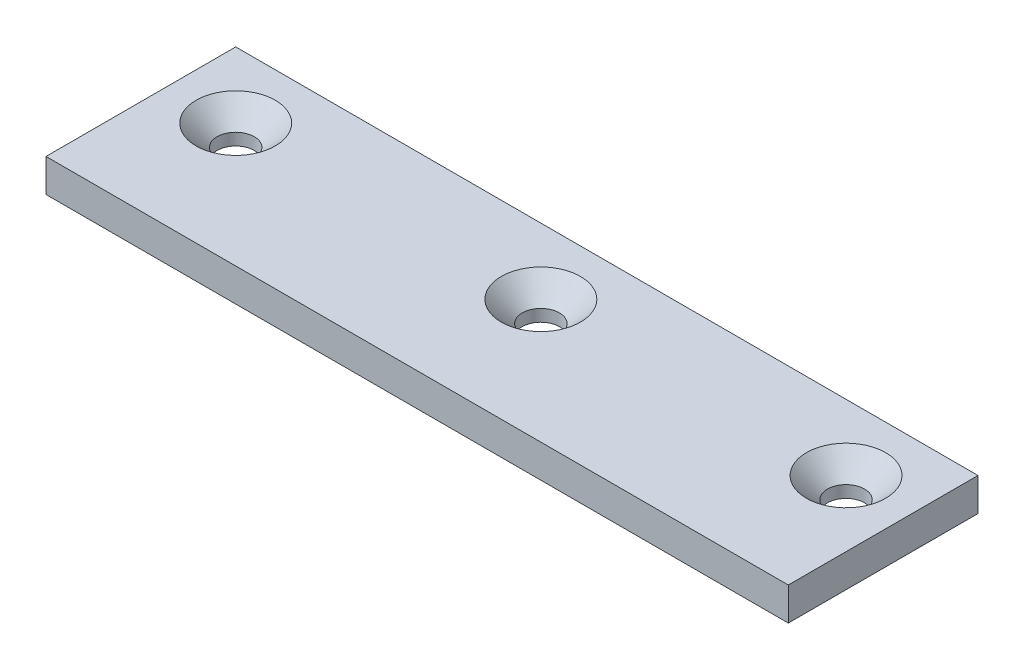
ISO-10303-21;
HEADER;
FILE_DESCRIPTION(('STEP AP214'),'2;1');
FILE_NAME('part.step','',(''),(''),'','','');
FILE_SCHEMA(('AUTOMOTIVE_DESIGN { 1 0 10303 214 1 1 1 1 }'));
ENDSEC;
DATA;
#1=APPLICATION_CONTEXT('core data for automotive mechanical design processes');
#2=APPLICATION_PROTOCOL_DEFINITION('international standard','automotive_design',2000,#1);
#3=PRODUCT_CONTEXT('',#1,'mechanical');
#4=PRODUCT('Part','Part','',(#3));
#5=PRODUCT_RELATED_PRODUCT_CATEGORY('part','',(#4));
#6=PRODUCT_DEFINITION_FORMATION('','',#4);
#7=PRODUCT_DEFINITION_CONTEXT('part definition',#1,'design');
#8=PRODUCT_DEFINITION('design','',#6,#7);
#9=PRODUCT_DEFINITION_SHAPE('','',#8);
#10=(LENGTH_UNIT() NAMED_UNIT(*) SI_UNIT(.MILLI.,.METRE.));
#11=(NAMED_UNIT(*) PLANE_ANGLE_UNIT() SI_UNIT($,.RADIAN.));
#12=(NAMED_UNIT(*) SI_UNIT($,.STERADIAN.) SOLID_ANGLE_UNIT());
#13=UNCERTAINTY_MEASURE_WITH_UNIT(LENGTH_MEASURE(1.E-05),#10,'distance_accuracy_value','');
#14=(GEOMETRIC_REPRESENTATION_CONTEXT(3) GLOBAL_UNCERTAINTY_ASSIGNED_CONTEXT((#13)) GLOBAL_UNIT_ASSIGNED_CONTEXT((#10,
#11,#12)) REPRESENTATION_CONTEXT('',''));
#15=CARTESIAN_POINT('',(0.,0.,0.));
#16=DIRECTION('',(0.,0.,1.));
#17=DIRECTION('',(1.,0.,0.));
#18=AXIS2_PLACEMENT_3D('',#15,#16,#17);
#19=CARTESIAN_POINT('',(-37.,3.99999999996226,-3.49999999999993));
#20=DIRECTION('',(0.,1.,0.));
#21=DIRECTION('',(0.,0.,1.));
#22=AXIS2_PLACEMENT_3D('',#19,#20,#21);
#23=CONICAL_SURFACE('',#22,4.80000000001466,0.785398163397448);
#24=CARTESIAN_POINT('',(-37.,1.45,-3.49999999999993));
#25=DIRECTION('',(0.,1.,0.));
#26=DIRECTION('',(0.,0.,1.));
#27=AXIS2_PLACEMENT_3D('',#24,#25,#26);
#28=CIRCLE('',#27,2.25);
#29=CARTESIAN_POINT('',(-37.,1.45,-1.24999999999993));
#30=VERTEX_POINT('',#29);
#31=EDGE_CURVE('E87',#30,#30,#28,.F.);
#32=ORIENTED_EDGE('',*,*,#31,.T.);
#33=EDGE_LOOP('',(#32));
#34=FACE_BOUND('',#33,.T.);
#35=CARTESIAN_POINT('',(-37.,3.99999999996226,-3.49999999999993));
#36=DIRECTION('',(0.,1.,0.));
#37=DIRECTION('',(0.,0.,1.));
#38=AXIS2_PLACEMENT_3D('',#35,#36,#37);
#39=CIRCLE('',#38,4.80000000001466);
#40=CARTESIAN_POINT('',(-37.,3.99999999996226,1.30000000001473));
#41=VERTEX_POINT('',#40);
#42=EDGE_CURVE('E20',#41,#41,#39,.F.);
#43=ORIENTED_EDGE('',*,*,#42,.F.);
#44=EDGE_LOOP('',(#43));
#45=FACE_BOUND('',#44,.T.);
#46=ADVANCED_FACE('F17',(#34,#45),#23,.F.);
#47=CARTESIAN_POINT('',(0.,3.99999999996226,-3.49999999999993));
#48=DIRECTION('',(0.,1.,0.));
#49=DIRECTION('',(0.,0.,1.));
#50=AXIS2_PLACEMENT_3D('',#47,#48,#49);
#51=CONICAL_SURFACE('',#50,4.79999999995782,0.785398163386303);
#52=CARTESIAN_POINT('',(0.,1.45,-3.49999999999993));
#53=DIRECTION('',(0.,1.,0.));
#54=DIRECTION('',(0.,0.,1.));
#55=AXIS2_PLACEMENT_3D('',#52,#53,#54);
#56=CIRCLE('',#55,2.25);
#57=CARTESIAN_POINT('',(0.,1.45,-1.24999999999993));
#58=VERTEX_POINT('',#57);
#59=EDGE_CURVE('E84',#58,#58,#56,.F.);
#60=ORIENTED_EDGE('',*,*,#59,.T.);
#61=EDGE_LOOP('',(#60));
#62=FACE_BOUND('',#61,.T.);
#63=CARTESIAN_POINT('',(0.,3.99999999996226,-3.49999999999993));
#64=DIRECTION('',(0.,1.,0.));
#65=DIRECTION('',(0.,0.,1.));
#66=AXIS2_PLACEMENT_3D('',#63,#64,#65);
#67=CIRCLE('',#66,4.79999999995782);
#68=CARTESIAN_POINT('',(0.,3.99999999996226,1.29999999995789));
#69=VERTEX_POINT('',#68);
#70=EDGE_CURVE('E102',#69,#69,#67,.F.);
#71=ORIENTED_EDGE('',*,*,#70,.F.);
#72=EDGE_LOOP('',(#71));
#73=FACE_BOUND('',#72,.T.);
#74=ADVANCED_FACE('F111',(#62,#73),#51,.F.);
#75=CARTESIAN_POINT('',(37.,3.99999999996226,-3.49999999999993));
#76=DIRECTION('',(0.,1.,0.));
#77=DIRECTION('',(0.,0.,1.));
#78=AXIS2_PLACEMENT_3D('',#75,#76,#77);
#79=CONICAL_SURFACE('',#78,4.80000000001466,0.785398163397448);
#80=CARTESIAN_POINT('',(37.,1.45,-3.49999999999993));
#81=DIRECTION('',(0.,1.,0.));
#82=DIRECTION('',(0.,0.,1.));
#83=AXIS2_PLACEMENT_3D('',#80,#81,#82);
#84=CIRCLE('',#83,2.25);
#85=CARTESIAN_POINT('',(37.,1.45,-1.24999999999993));
#86=VERTEX_POINT('',#85);
#87=EDGE_CURVE('E67',#86,#86,#84,.F.);
#88=ORIENTED_EDGE('',*,*,#87,.T.);
#89=EDGE_LOOP('',(#88));
#90=FACE_BOUND('',#89,.T.);
#91=CARTESIAN_POINT('',(37.,3.99999999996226,-3.49999999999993));
#92=DIRECTION('',(0.,1.,0.));
#93=DIRECTION('',(0.,0.,1.));
#94=AXIS2_PLACEMENT_3D('',#91,#92,#93);
#95=CIRCLE('',#94,4.80000000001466);
#96=CARTESIAN_POINT('',(37.,3.99999999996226,1.30000000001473));
#97=VERTEX_POINT('',#96);
#98=EDGE_CURVE('E90',#97,#97,#95,.F.);
#99=ORIENTED_EDGE('',*,*,#98,.F.);
#100=EDGE_LOOP('',(#99));
#101=FACE_BOUND('',#100,.T.);
#102=ADVANCED_FACE('F117',(#90,#101),#79,.F.);
#103=CARTESIAN_POINT('',(0.,4.,0.));
#104=DIRECTION('',(0.,1.,0.));
#105=DIRECTION('',(0.,0.,1.));
#106=AXIS2_PLACEMENT_3D('',#103,#104,#105);
#107=PLANE('',#106);
#108=DIRECTION('',(0.,0.,-1.));
#109=VECTOR('',#108,1.);
#110=CARTESIAN_POINT('',(-45.,4.,-11.5));
#111=LINE('',#110,#109);
#112=CARTESIAN_POINT('',(-45.,4.,-11.5));
#113=VERTEX_POINT('',#112);
#114=CARTESIAN_POINT('',(-45.,4.,11.5));
#115=VERTEX_POINT('',#114);
#116=EDGE_CURVE('E55',#113,#115,#111,.F.);
#117=ORIENTED_EDGE('',*,*,#116,.T.);
#118=DIRECTION('',(-1.,0.,0.));
#119=VECTOR('',#118,1.);
#120=CARTESIAN_POINT('',(-45.,4.,11.5));
#121=LINE('',#120,#119);
#122=CARTESIAN_POINT('',(45.,4.,11.5));
#123=VERTEX_POINT('',#122);
#124=EDGE_CURVE('E245',#115,#123,#121,.F.);
#125=ORIENTED_EDGE('',*,*,#124,.T.);
#126=DIRECTION('',(0.,0.,1.));
#127=VECTOR('',#126,1.);
#128=CARTESIAN_POINT('',(45.,4.,-11.5));
#129=LINE('',#128,#127);
#130=CARTESIAN_POINT('',(45.,4.,-11.5));
#131=VERTEX_POINT('',#130);
#132=EDGE_CURVE('E61',#123,#131,#129,.F.);
#133=ORIENTED_EDGE('',*,*,#132,.T.);
#134=DIRECTION('',(1.,0.,0.));
#135=VECTOR('',#134,1.);
#136=CARTESIAN_POINT('',(-45.,4.,-11.5));
#137=LINE('',#136,#135);
#138=EDGE_CURVE('E58',#131,#113,#137,.F.);
#139=ORIENTED_EDGE('',*,*,#138,.T.);
#140=EDGE_LOOP('',(#117,#125,#133,#139));
#141=FACE_BOUND('',#140,.T.);
#142=ORIENTED_EDGE('',*,*,#98,.T.);
#143=EDGE_LOOP('',(#142));
#144=FACE_BOUND('',#143,.T.);
#145=ORIENTED_EDGE('',*,*,#70,.T.);
#146=EDGE_LOOP('',(#145));
#147=FACE_BOUND('',#146,.T.);
#148=ORIENTED_EDGE('',*,*,#42,.T.);
#149=EDGE_LOOP('',(#148));
#150=FACE_BOUND('',#149,.T.);
#151=ADVANCED_FACE('F59',(#141,#144,#147,#150),#107,.T.);
#152=CARTESIAN_POINT('',(-37.,4.,-3.49999999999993));
#153=DIRECTION('',(0.,1.,0.));
#154=DIRECTION('',(0.,0.,1.));
#155=AXIS2_PLACEMENT_3D('',#152,#153,#154);
#156=CYLINDRICAL_SURFACE('',#155,2.25);
#157=CARTESIAN_POINT('',(-37.,0.,-3.49999999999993));
#158=DIRECTION('',(0.,1.,0.));
#159=DIRECTION('',(0.,0.,1.));
#160=AXIS2_PLACEMENT_3D('',#157,#158,#159);
#161=CIRCLE('',#160,2.25);
#162=CARTESIAN_POINT('',(-37.,0.,-1.24999999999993));
#163=VERTEX_POINT('',#162);
#164=EDGE_CURVE('E97',#163,#163,#161,.F.);
#165=ORIENTED_EDGE('',*,*,#164,.T.);
#166=EDGE_LOOP('',(#165));
#167=FACE_BOUND('',#166,.T.);
#168=ORIENTED_EDGE('',*,*,#31,.F.);
#169=EDGE_LOOP('',(#168));
#170=FACE_BOUND('',#169,.T.);
#171=ADVANCED_FACE('F146',(#167,#170),#156,.F.);
#172=CARTESIAN_POINT('',(0.,4.,-3.49999999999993));
#173=DIRECTION('',(0.,1.,0.));
#174=DIRECTION('',(0.,0.,1.));
#175=AXIS2_PLACEMENT_3D('',#172,#173,#174);
#176=CYLINDRICAL_SURFACE('',#175,2.25);
#177=CARTESIAN_POINT('',(0.,0.,-3.49999999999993));
#178=DIRECTION('',(0.,1.,0.));
#179=DIRECTION('',(0.,0.,1.));
#180=AXIS2_PLACEMENT_3D('',#177,#178,#179);
#181=CIRCLE('',#180,2.25);
#182=CARTESIAN_POINT('',(0.,0.,-1.24999999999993));
#183=VERTEX_POINT('',#182);
#184=EDGE_CURVE('E94',#183,#183,#181,.F.);
#185=ORIENTED_EDGE('',*,*,#184,.T.);
#186=EDGE_LOOP('',(#185));
#187=FACE_BOUND('',#186,.T.);
#188=ORIENTED_EDGE('',*,*,#59,.F.);
#189=EDGE_LOOP('',(#188));
#190=FACE_BOUND('',#189,.T.);
#191=ADVANCED_FACE('F142',(#187,#190),#176,.F.);
#192=CARTESIAN_POINT('',(37.,4.,-3.49999999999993));
#193=DIRECTION('',(0.,1.,0.));
#194=DIRECTION('',(0.,0.,1.));
#195=AXIS2_PLACEMENT_3D('',#192,#193,#194);
#196=CYLINDRICAL_SURFACE('',#195,2.25);
#197=CARTESIAN_POINT('',(37.,0.,-3.49999999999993));
#198=DIRECTION('',(0.,1.,0.));
#199=DIRECTION('',(0.,0.,1.));
#200=AXIS2_PLACEMENT_3D('',#197,#198,#199);
#201=CIRCLE('',#200,2.25);
#202=CARTESIAN_POINT('',(37.,0.,-1.24999999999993));
#203=VERTEX_POINT('',#202);
#204=EDGE_CURVE('E91',#203,#203,#201,.F.);
#205=ORIENTED_EDGE('',*,*,#204,.T.);
#206=EDGE_LOOP('',(#205));
#207=FACE_BOUND('',#206,.T.);
#208=ORIENTED_EDGE('',*,*,#87,.F.);
#209=EDGE_LOOP('',(#208));
#210=FACE_BOUND('',#209,.T.);
#211=ADVANCED_FACE('F139',(#207,#210),#196,.F.);
#212=CARTESIAN_POINT('',(-45.,4.,-11.5));
#213=DIRECTION('',(0.,0.,1.));
#214=DIRECTION('',(1.,0.,0.));
#215=AXIS2_PLACEMENT_3D('',#212,#213,#214);
#216=PLANE('',#215);
#217=DIRECTION('',(0.,1.,0.));
#218=VECTOR('',#217,1.);
#219=CARTESIAN_POINT('',(-45.,4.,-11.5));
#220=LINE('',#219,#218);
#221=CARTESIAN_POINT('',(-45.,0.,-11.5));
#222=VERTEX_POINT('',#221);
#223=EDGE_CURVE('E66',#222,#113,#220,.T.);
#224=ORIENTED_EDGE('',*,*,#223,.T.);
#225=ORIENTED_EDGE('',*,*,#138,.F.);
#226=DIRECTION('',(0.,1.,0.));
#227=VECTOR('',#226,1.);
#228=CARTESIAN_POINT('',(45.,4.,-11.5));
#229=LINE('',#228,#227);
#230=CARTESIAN_POINT('',(45.,0.,-11.5));
#231=VERTEX_POINT('',#230);
#232=EDGE_CURVE('E100',#131,#231,#229,.F.);
#233=ORIENTED_EDGE('',*,*,#232,.T.);
#234=DIRECTION('',(1.,0.,0.));
#235=VECTOR('',#234,1.);
#236=CARTESIAN_POINT('',(0.,0.,-11.5));
#237=LINE('',#236,#235);
#238=EDGE_CURVE('E78',#231,#222,#237,.F.);
#239=ORIENTED_EDGE('',*,*,#238,.T.);
#240=EDGE_LOOP('',(#224,#225,#233,#239));
#241=FACE_BOUND('',#240,.T.);
#242=ADVANCED_FACE('F77',(#241),#216,.F.);
#243=CARTESIAN_POINT('',(-45.,4.,-11.5));
#244=DIRECTION('',(1.,0.,0.));
#245=DIRECTION('',(0.,0.,-1.));
#246=AXIS2_PLACEMENT_3D('',#243,#244,#245);
#247=PLANE('',#246);
#248=DIRECTION('',(0.,1.,0.));
#249=VECTOR('',#248,1.);
#250=CARTESIAN_POINT('',(-45.,4.,11.5));
#251=LINE('',#250,#249);
#252=CARTESIAN_POINT('',(-45.,0.,11.5));
#253=VERTEX_POINT('',#252);
#254=EDGE_CURVE('E74',#253,#115,#251,.T.);
#255=ORIENTED_EDGE('',*,*,#254,.T.);
#256=ORIENTED_EDGE('',*,*,#116,.F.);
#257=ORIENTED_EDGE('',*,*,#223,.F.);
#258=DIRECTION('',(0.,0.,1.));
#259=VECTOR('',#258,1.);
#260=CARTESIAN_POINT('',(-45.,0.,0.));
#261=LINE('',#260,#259);
#262=EDGE_CURVE('E252',#222,#253,#261,.T.);
#263=ORIENTED_EDGE('',*,*,#262,.T.);
#264=EDGE_LOOP('',(#255,#256,#257,#263));
#265=FACE_BOUND('',#264,.T.);
#266=ADVANCED_FACE('F71',(#265),#247,.F.);
#267=CARTESIAN_POINT('',(-45.,4.,11.5));
#268=DIRECTION('',(0.,0.,-1.));
#269=DIRECTION('',(-1.,0.,0.));
#270=AXIS2_PLACEMENT_3D('',#267,#268,#269);
#271=PLANE('',#270);
#272=DIRECTION('',(0.,1.,0.));
#273=VECTOR('',#272,1.);
#274=CARTESIAN_POINT('',(45.,4.,11.5));
#275=LINE('',#274,#273);
#276=CARTESIAN_POINT('',(45.,0.,11.5));
#277=VERTEX_POINT('',#276);
#278=EDGE_CURVE('E34',#277,#123,#275,.T.);
#279=ORIENTED_EDGE('',*,*,#278,.T.);
#280=ORIENTED_EDGE('',*,*,#124,.F.);
#281=ORIENTED_EDGE('',*,*,#254,.F.);
#282=DIRECTION('',(1.,0.,0.));
#283=VECTOR('',#282,1.);
#284=CARTESIAN_POINT('',(0.,0.,11.5));
#285=LINE('',#284,#283);
#286=EDGE_CURVE('E26',#253,#277,#285,.T.);
#287=ORIENTED_EDGE('',*,*,#286,.T.);
#288=EDGE_LOOP('',(#279,#280,#281,#287));
#289=FACE_BOUND('',#288,.T.);
#290=ADVANCED_FACE('F127',(#289),#271,.F.);
#291=CARTESIAN_POINT('',(45.,4.,-11.5));
#292=DIRECTION('',(-1.,0.,0.));
#293=DIRECTION('',(0.,0.,1.));
#294=AXIS2_PLACEMENT_3D('',#291,#292,#293);
#295=PLANE('',#294);
#296=ORIENTED_EDGE('',*,*,#232,.F.);
#297=ORIENTED_EDGE('',*,*,#132,.F.);
#298=ORIENTED_EDGE('',*,*,#278,.F.);
#299=DIRECTION('',(0.,0.,1.));
#300=VECTOR('',#299,1.);
#301=CARTESIAN_POINT('',(45.,0.,0.));
#302=LINE('',#301,#300);
#303=EDGE_CURVE('E11',#277,#231,#302,.F.);
#304=ORIENTED_EDGE('',*,*,#303,.T.);
#305=EDGE_LOOP('',(#296,#297,#298,#304));
#306=FACE_BOUND('',#305,.T.);
#307=ADVANCED_FACE('F121',(#306),#295,.F.);
#308=CARTESIAN_POINT('',(0.,0.,0.));
#309=DIRECTION('',(0.,1.,0.));
#310=DIRECTION('',(0.,0.,1.));
#311=AXIS2_PLACEMENT_3D('',#308,#309,#310);
#312=PLANE('',#311);
#313=ORIENTED_EDGE('',*,*,#286,.F.);
#314=ORIENTED_EDGE('',*,*,#262,.F.);
#315=ORIENTED_EDGE('',*,*,#238,.F.);
#316=ORIENTED_EDGE('',*,*,#303,.F.);
#317=EDGE_LOOP('',(#313,#314,#315,#316));
#318=FACE_BOUND('',#317,.T.);
#319=ORIENTED_EDGE('',*,*,#204,.F.);
#320=EDGE_LOOP('',(#319));
#321=FACE_BOUND('',#320,.T.);
#322=ORIENTED_EDGE('',*,*,#184,.F.);
#323=EDGE_LOOP('',(#322));
#324=FACE_BOUND('',#323,.T.);
#325=ORIENTED_EDGE('',*,*,#164,.F.);
#326=EDGE_LOOP('',(#325));
#327=FACE_BOUND('',#326,.T.);
#328=ADVANCED_FACE('F119',(#318,#321,#324,#327),#312,.F.);
#329=CLOSED_SHELL('',(#46,#74,#102,#151,#171,#191,#211,#242,#266,#290,#307,#328));
#330=MANIFOLD_SOLID_BREP('B1',#329);
#331=ADVANCED_BREP_SHAPE_REPRESENTATION('',(#18,#330),#14);
#332=SHAPE_DEFINITION_REPRESENTATION(#9,#331);
ENDSEC;
END-ISO-10303-21;
